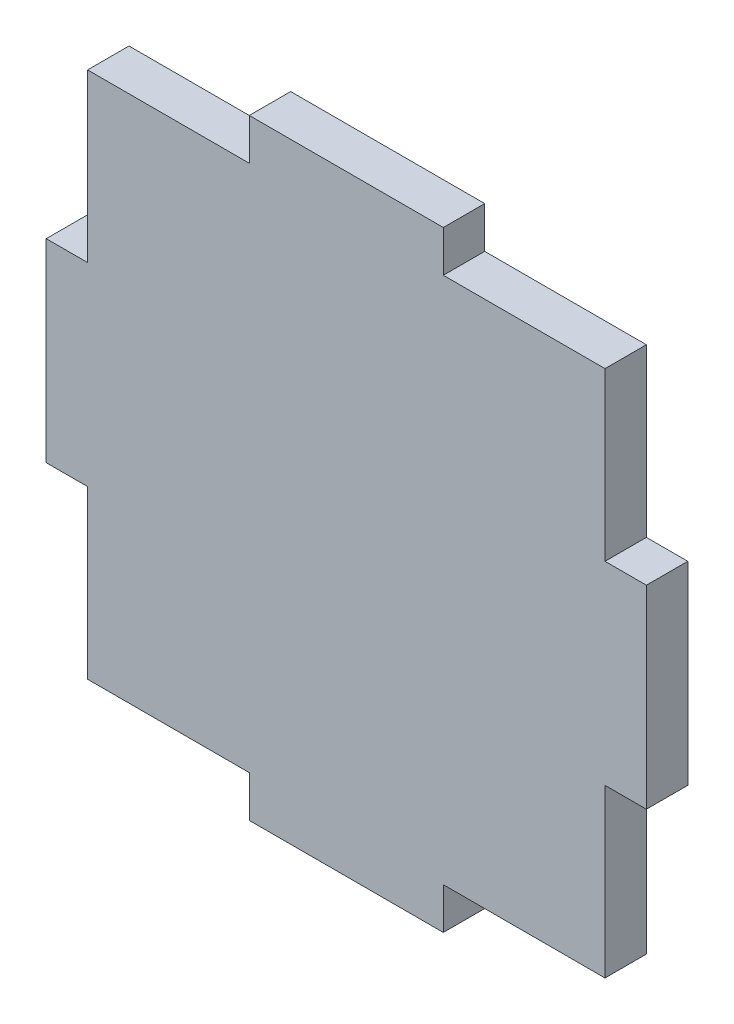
from build123d import *

# Parameters (mm, degrees)
SKETCH1_W           = 200
SKETCH1_H           = 204
SKETCH1_W_2         = 16
SKETCH1_H_2         = 75
SKETCH1_W_3         = 75
SKETCH1_H_3         = 16
BOSS_EXTRUDE1_DEPTH = 16


with BuildPart() as part:
    # Sketch1 → Boss-Extrude1 (new body)
    with BuildSketch(Plane.XY):
        with Locations((100, 102)):
            Rectangle(SKETCH1_W, SKETCH1_H)
        with Locations((208, 102)):
            Rectangle(SKETCH1_W_2, SKETCH1_H_2)
        with Locations((-8, 102)):
            Rectangle(SKETCH1_W_2, SKETCH1_H_2)
        with Locations((100, 212)):
            Rectangle(SKETCH1_W_3, SKETCH1_H_3)
        with Locations((100, -8)):
            Rectangle(SKETCH1_W_3, SKETCH1_H_3)
    extrude(amount=BOSS_EXTRUDE1_DEPTH)


solid = part.part
